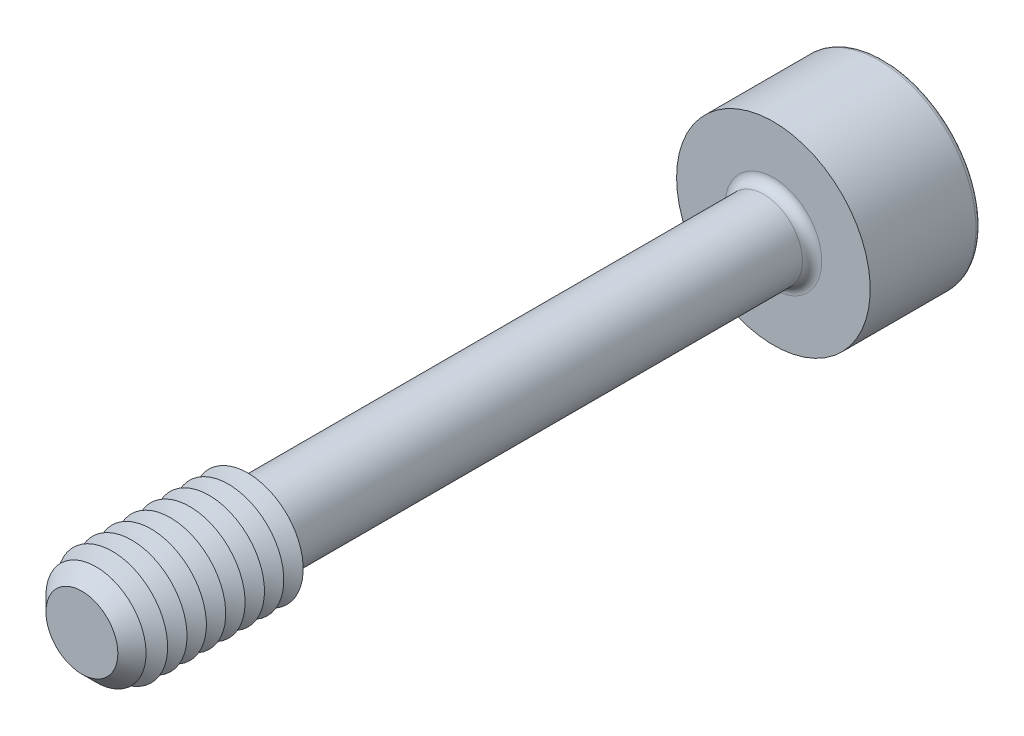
ISO-10303-21;
HEADER;
FILE_DESCRIPTION(('STEP AP214'),'2;1');
FILE_NAME('part.step','',(''),(''),'','','');
FILE_SCHEMA(('AUTOMOTIVE_DESIGN { 1 0 10303 214 1 1 1 1 }'));
ENDSEC;
DATA;
#1=APPLICATION_CONTEXT('core data for automotive mechanical design processes');
#2=APPLICATION_PROTOCOL_DEFINITION('international standard','automotive_design',2000,#1);
#3=PRODUCT_CONTEXT('',#1,'mechanical');
#4=PRODUCT('Part','Part','',(#3));
#5=PRODUCT_RELATED_PRODUCT_CATEGORY('part','',(#4));
#6=PRODUCT_DEFINITION_FORMATION('','',#4);
#7=PRODUCT_DEFINITION_CONTEXT('part definition',#1,'design');
#8=PRODUCT_DEFINITION('design','',#6,#7);
#9=PRODUCT_DEFINITION_SHAPE('','',#8);
#10=(LENGTH_UNIT() NAMED_UNIT(*) SI_UNIT(.MILLI.,.METRE.));
#11=(NAMED_UNIT(*) PLANE_ANGLE_UNIT() SI_UNIT($,.RADIAN.));
#12=(NAMED_UNIT(*) SI_UNIT($,.STERADIAN.) SOLID_ANGLE_UNIT());
#13=UNCERTAINTY_MEASURE_WITH_UNIT(LENGTH_MEASURE(1.E-05),#10,'distance_accuracy_value','');
#14=(GEOMETRIC_REPRESENTATION_CONTEXT(3) GLOBAL_UNCERTAINTY_ASSIGNED_CONTEXT((#13)) GLOBAL_UNIT_ASSIGNED_CONTEXT((#10,
#11,#12)) REPRESENTATION_CONTEXT('',''));
#15=CARTESIAN_POINT('',(0.,0.,0.));
#16=DIRECTION('',(0.,0.,1.));
#17=DIRECTION('',(1.,0.,0.));
#18=AXIS2_PLACEMENT_3D('',#15,#16,#17);
#19=CARTESIAN_POINT('',(-0.866025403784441,-1.5,-13.5));
#20=DIRECTION('',(0.,0.,1.));
#21=DIRECTION('',(1.,0.,0.));
#22=AXIS2_PLACEMENT_3D('',#19,#20,#21);
#23=PLANE('',#22);
#24=DIRECTION('',(1.,0.,0.));
#25=VECTOR('',#24,1.);
#26=CARTESIAN_POINT('',(-0.866025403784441,-1.5,-13.5));
#27=LINE('',#26,#25);
#28=CARTESIAN_POINT('',(0.,-1.5,-13.5));
#29=VERTEX_POINT('',#28);
#30=CARTESIAN_POINT('',(0.866025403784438,-1.5,-13.5));
#31=VERTEX_POINT('',#30);
#32=EDGE_CURVE('E761',#29,#31,#27,.T.);
#33=ORIENTED_EDGE('',*,*,#32,.F.);
#34=CARTESIAN_POINT('',(0.,0.,-13.5));
#35=DIRECTION('',(0.,0.,1.));
#36=DIRECTION('',(0.,-1.,0.));
#37=AXIS2_PLACEMENT_3D('',#34,#35,#36);
#38=CIRCLE('',#37,1.5);
#39=CARTESIAN_POINT('',(1.29903810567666,-0.75,-13.5));
#40=VERTEX_POINT('',#39);
#41=EDGE_CURVE('E53',#29,#40,#38,.T.);
#42=ORIENTED_EDGE('',*,*,#41,.T.);
#43=DIRECTION('',(0.5,0.866025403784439,0.));
#44=VECTOR('',#43,1.);
#45=CARTESIAN_POINT('',(0.866025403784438,-1.5,-13.5));
#46=LINE('',#45,#44);
#47=EDGE_CURVE('E748',#31,#40,#46,.T.);
#48=ORIENTED_EDGE('',*,*,#47,.F.);
#49=EDGE_LOOP('',(#33,#42,#48));
#50=FACE_BOUND('',#49,.T.);
#51=ADVANCED_FACE('F41',(#50),#23,.F.);
#52=CARTESIAN_POINT('',(1.73205080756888,0.,-13.5));
#53=VERTEX_POINT('',#52);
#54=EDGE_CURVE('E758',#40,#53,#46,.T.);
#55=ORIENTED_EDGE('',*,*,#54,.F.);
#56=CARTESIAN_POINT('',(1.29903810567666,0.749999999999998,-13.5));
#57=VERTEX_POINT('',#56);
#58=EDGE_CURVE('E11',#40,#57,#38,.T.);
#59=ORIENTED_EDGE('',*,*,#58,.T.);
#60=DIRECTION('',(-0.5,0.866025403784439,0.));
#61=VECTOR('',#60,1.);
#62=CARTESIAN_POINT('',(1.73205080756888,0.,-13.5));
#63=LINE('',#62,#61);
#64=EDGE_CURVE('E747',#53,#57,#63,.T.);
#65=ORIENTED_EDGE('',*,*,#64,.F.);
#66=EDGE_LOOP('',(#55,#59,#65));
#67=FACE_BOUND('',#66,.T.);
#68=ADVANCED_FACE('F133',(#67),#23,.F.);
#69=CARTESIAN_POINT('',(0.866025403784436,1.5,-13.5));
#70=VERTEX_POINT('',#69);
#71=EDGE_CURVE('E743',#57,#70,#63,.T.);
#72=ORIENTED_EDGE('',*,*,#71,.F.);
#73=CARTESIAN_POINT('',(0.,1.5,-13.5));
#74=VERTEX_POINT('',#73);
#75=EDGE_CURVE('E51',#57,#74,#38,.T.);
#76=ORIENTED_EDGE('',*,*,#75,.T.);
#77=DIRECTION('',(-1.,0.,0.));
#78=VECTOR('',#77,1.);
#79=CARTESIAN_POINT('',(0.866025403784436,1.5,-13.5));
#80=LINE('',#79,#78);
#81=EDGE_CURVE('E177',#70,#74,#80,.T.);
#82=ORIENTED_EDGE('',*,*,#81,.F.);
#83=EDGE_LOOP('',(#72,#76,#82));
#84=FACE_BOUND('',#83,.T.);
#85=ADVANCED_FACE('F139',(#84),#23,.F.);
#86=CARTESIAN_POINT('',(-0.866025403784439,1.5,-13.5));
#87=VERTEX_POINT('',#86);
#88=EDGE_CURVE('E753',#74,#87,#80,.T.);
#89=ORIENTED_EDGE('',*,*,#88,.F.);
#90=CARTESIAN_POINT('',(-1.29903810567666,0.749999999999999,-13.5));
#91=VERTEX_POINT('',#90);
#92=EDGE_CURVE('E264',#74,#91,#38,.T.);
#93=ORIENTED_EDGE('',*,*,#92,.T.);
#94=DIRECTION('',(-0.5,-0.866025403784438,0.));
#95=VECTOR('',#94,1.);
#96=CARTESIAN_POINT('',(-0.866025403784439,1.5,-13.5));
#97=LINE('',#96,#95);
#98=EDGE_CURVE('E176',#87,#91,#97,.T.);
#99=ORIENTED_EDGE('',*,*,#98,.F.);
#100=EDGE_LOOP('',(#89,#93,#99));
#101=FACE_BOUND('',#100,.T.);
#102=ADVANCED_FACE('F157',(#101),#23,.F.);
#103=CARTESIAN_POINT('',(-1.73205080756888,0.,-13.5));
#104=VERTEX_POINT('',#103);
#105=EDGE_CURVE('E170',#91,#104,#97,.T.);
#106=ORIENTED_EDGE('',*,*,#105,.F.);
#107=CARTESIAN_POINT('',(-1.29903810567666,-0.749999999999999,-13.5));
#108=VERTEX_POINT('',#107);
#109=EDGE_CURVE('E172',#91,#108,#38,.T.);
#110=ORIENTED_EDGE('',*,*,#109,.T.);
#111=DIRECTION('',(0.5,-0.866025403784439,0.));
#112=VECTOR('',#111,1.);
#113=CARTESIAN_POINT('',(-1.73205080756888,0.,-13.5));
#114=LINE('',#113,#112);
#115=EDGE_CURVE('E174',#104,#108,#114,.T.);
#116=ORIENTED_EDGE('',*,*,#115,.F.);
#117=EDGE_LOOP('',(#106,#110,#116));
#118=FACE_BOUND('',#117,.T.);
#119=ADVANCED_FACE('F146',(#118),#23,.F.);
#120=CARTESIAN_POINT('',(0.,0.,-16.5));
#121=DIRECTION('',(0.,0.,-1.));
#122=DIRECTION('',(-1.,0.,0.));
#123=AXIS2_PLACEMENT_3D('',#120,#121,#122);
#124=PLANE('',#123);
#125=CARTESIAN_POINT('',(0.,0.,-16.5));
#126=DIRECTION('',(0.,0.,-1.));
#127=DIRECTION('',(-1.,0.,0.));
#128=AXIS2_PLACEMENT_3D('',#125,#126,#127);
#129=CIRCLE('',#128,3.325);
#130=CARTESIAN_POINT('',(-3.325,0.,-16.5));
#131=VERTEX_POINT('',#130);
#132=EDGE_CURVE('E250',#131,#131,#129,.T.);
#133=ORIENTED_EDGE('',*,*,#132,.T.);
#134=EDGE_LOOP('',(#133));
#135=FACE_BOUND('',#134,.T.);
#136=DIRECTION('',(-0.5,-0.866025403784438,0.));
#137=VECTOR('',#136,1.);
#138=CARTESIAN_POINT('',(-0.866025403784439,1.5,-16.5));
#139=LINE('',#138,#137);
#140=CARTESIAN_POINT('',(-0.866025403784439,1.5,-16.5));
#141=VERTEX_POINT('',#140);
#142=CARTESIAN_POINT('',(-1.73205080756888,0.,-16.5));
#143=VERTEX_POINT('',#142);
#144=EDGE_CURVE('E212',#141,#143,#139,.T.);
#145=ORIENTED_EDGE('',*,*,#144,.T.);
#146=DIRECTION('',(0.5,-0.866025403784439,0.));
#147=VECTOR('',#146,1.);
#148=CARTESIAN_POINT('',(-1.73205080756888,0.,-16.5));
#149=LINE('',#148,#147);
#150=CARTESIAN_POINT('',(-0.866025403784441,-1.5,-16.5));
#151=VERTEX_POINT('',#150);
#152=EDGE_CURVE('E67',#143,#151,#149,.T.);
#153=ORIENTED_EDGE('',*,*,#152,.T.);
#154=DIRECTION('',(1.,0.,0.));
#155=VECTOR('',#154,1.);
#156=CARTESIAN_POINT('',(-0.866025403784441,-1.5,-16.5));
#157=LINE('',#156,#155);
#158=CARTESIAN_POINT('',(0.866025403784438,-1.5,-16.5));
#159=VERTEX_POINT('',#158);
#160=EDGE_CURVE('E196',#151,#159,#157,.T.);
#161=ORIENTED_EDGE('',*,*,#160,.T.);
#162=DIRECTION('',(0.5,0.866025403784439,0.));
#163=VECTOR('',#162,1.);
#164=CARTESIAN_POINT('',(0.866025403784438,-1.5,-16.5));
#165=LINE('',#164,#163);
#166=CARTESIAN_POINT('',(1.73205080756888,0.,-16.5));
#167=VERTEX_POINT('',#166);
#168=EDGE_CURVE('E200',#159,#167,#165,.T.);
#169=ORIENTED_EDGE('',*,*,#168,.T.);
#170=DIRECTION('',(-0.5,0.866025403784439,0.));
#171=VECTOR('',#170,1.);
#172=CARTESIAN_POINT('',(1.73205080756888,0.,-16.5));
#173=LINE('',#172,#171);
#174=CARTESIAN_POINT('',(0.866025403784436,1.5,-16.5));
#175=VERTEX_POINT('',#174);
#176=EDGE_CURVE('E204',#167,#175,#173,.T.);
#177=ORIENTED_EDGE('',*,*,#176,.T.);
#178=DIRECTION('',(-1.,0.,0.));
#179=VECTOR('',#178,1.);
#180=CARTESIAN_POINT('',(0.866025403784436,1.5,-16.5));
#181=LINE('',#180,#179);
#182=EDGE_CURVE('E208',#175,#141,#181,.T.);
#183=ORIENTED_EDGE('',*,*,#182,.T.);
#184=EDGE_LOOP('',(#145,#153,#161,#169,#177,#183));
#185=FACE_BOUND('',#184,.T.);
#186=ADVANCED_FACE('F156',(#135,#185),#124,.T.);
#187=CARTESIAN_POINT('',(0.,0.,12.5));
#188=DIRECTION('',(0.,0.,-1.));
#189=DIRECTION('',(-1.,0.,0.));
#190=AXIS2_PLACEMENT_3D('',#187,#188,#189);
#191=CYLINDRICAL_SURFACE('',#190,1.4);
#192=CARTESIAN_POINT('',(0.,0.,-12.15));
#193=DIRECTION('',(0.,0.,-1.));
#194=DIRECTION('',(-1.,0.,0.));
#195=AXIS2_PLACEMENT_3D('',#192,#193,#194);
#196=CIRCLE('',#195,1.4);
#197=CARTESIAN_POINT('',(-1.4,0.,-12.15));
#198=VERTEX_POINT('',#197);
#199=EDGE_CURVE('E246',#198,#198,#196,.F.);
#200=ORIENTED_EDGE('',*,*,#199,.T.);
#201=EDGE_LOOP('',(#200));
#202=FACE_BOUND('',#201,.T.);
#203=CARTESIAN_POINT('',(0.,0.,6.15358983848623));
#204=DIRECTION('',(0.,0.,-1.));
#205=DIRECTION('',(0.,1.,0.));
#206=AXIS2_PLACEMENT_3D('',#203,#204,#205);
#207=CIRCLE('',#206,1.4);
#208=CARTESIAN_POINT('',(0.,1.4,6.15358983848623));
#209=VERTEX_POINT('',#208);
#210=EDGE_CURVE('E234',#209,#209,#207,.T.);
#211=ORIENTED_EDGE('',*,*,#210,.T.);
#212=EDGE_LOOP('',(#211));
#213=FACE_BOUND('',#212,.T.);
#214=ADVANCED_FACE('F163',(#202,#213),#191,.T.);
#215=CARTESIAN_POINT('',(0.,0.,6.15358983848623));
#216=DIRECTION('',(0.,0.,1.));
#217=DIRECTION('',(0.,-1.,0.));
#218=AXIS2_PLACEMENT_3D('',#215,#216,#217);
#219=CONICAL_SURFACE('',#218,1.4,1.0471975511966);
#220=CARTESIAN_POINT('',(0.,0.,6.5));
#221=DIRECTION('',(0.,0.,-1.));
#222=DIRECTION('',(-1.,0.,0.));
#223=AXIS2_PLACEMENT_3D('',#220,#221,#222);
#224=CIRCLE('',#223,2.);
#225=CARTESIAN_POINT('',(-2.,0.,6.5));
#226=VERTEX_POINT('',#225);
#227=EDGE_CURVE('E267',#226,#226,#224,.T.);
#228=ORIENTED_EDGE('',*,*,#227,.T.);
#229=EDGE_LOOP('',(#228));
#230=FACE_BOUND('',#229,.T.);
#231=ORIENTED_EDGE('',*,*,#210,.F.);
#232=EDGE_LOOP('',(#231));
#233=FACE_BOUND('',#232,.T.);
#234=ADVANCED_FACE('F512',(#230,#233),#219,.T.);
#235=CARTESIAN_POINT('',(0.,0.,-12.5));
#236=DIRECTION('',(0.,0.,-1.));
#237=DIRECTION('',(-1.,0.,0.));
#238=AXIS2_PLACEMENT_3D('',#235,#236,#237);
#239=PLANE('',#238);
#240=CARTESIAN_POINT('',(0.,0.,-12.5));
#241=DIRECTION('',(0.,0.,-1.));
#242=DIRECTION('',(-1.,0.,0.));
#243=AXIS2_PLACEMENT_3D('',#240,#241,#242);
#244=CIRCLE('',#243,1.75);
#245=CARTESIAN_POINT('',(-1.75,0.,-12.5));
#246=VERTEX_POINT('',#245);
#247=EDGE_CURVE('E242',#246,#246,#244,.T.);
#248=ORIENTED_EDGE('',*,*,#247,.T.);
#249=EDGE_LOOP('',(#248));
#250=FACE_BOUND('',#249,.T.);
#251=CARTESIAN_POINT('',(0.,0.,-12.5));
#252=DIRECTION('',(0.,0.,-1.));
#253=DIRECTION('',(-1.,0.,0.));
#254=AXIS2_PLACEMENT_3D('',#251,#252,#253);
#255=CIRCLE('',#254,3.5);
#256=CARTESIAN_POINT('',(-3.5,0.,-12.5));
#257=VERTEX_POINT('',#256);
#258=EDGE_CURVE('E230',#257,#257,#255,.T.);
#259=ORIENTED_EDGE('',*,*,#258,.F.);
#260=EDGE_LOOP('',(#259));
#261=FACE_BOUND('',#260,.T.);
#262=ADVANCED_FACE('F505',(#250,#261),#239,.F.);
#263=CARTESIAN_POINT('',(0.,0.,-16.5));
#264=DIRECTION('',(0.,0.,1.));
#265=DIRECTION('',(1.,0.,0.));
#266=AXIS2_PLACEMENT_3D('',#263,#264,#265);
#267=CYLINDRICAL_SURFACE('',#266,3.5);
#268=CARTESIAN_POINT('',(0.,0.,-16.325));
#269=DIRECTION('',(0.,0.,-1.));
#270=DIRECTION('',(-1.,0.,0.));
#271=AXIS2_PLACEMENT_3D('',#268,#269,#270);
#272=CIRCLE('',#271,3.5);
#273=CARTESIAN_POINT('',(-3.5,0.,-16.325));
#274=VERTEX_POINT('',#273);
#275=EDGE_CURVE('E253',#274,#274,#272,.F.);
#276=ORIENTED_EDGE('',*,*,#275,.T.);
#277=EDGE_LOOP('',(#276));
#278=FACE_BOUND('',#277,.T.);
#279=ORIENTED_EDGE('',*,*,#258,.T.);
#280=EDGE_LOOP('',(#279));
#281=FACE_BOUND('',#280,.T.);
#282=ADVANCED_FACE('F511',(#278,#281),#267,.T.);
#283=CARTESIAN_POINT('',(-1.73205080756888,0.,-13.5));
#284=DIRECTION('',(0.866025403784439,0.5,0.));
#285=DIRECTION('',(-0.5,0.866025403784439,0.));
#286=AXIS2_PLACEMENT_3D('',#283,#284,#285);
#287=PLANE('',#286);
#288=ORIENTED_EDGE('',*,*,#152,.F.);
#289=DIRECTION('',(0.,0.,-1.));
#290=VECTOR('',#289,1.);
#291=CARTESIAN_POINT('',(-1.73205080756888,0.,-13.5));
#292=LINE('',#291,#290);
#293=EDGE_CURVE('E186',#104,#143,#292,.T.);
#294=ORIENTED_EDGE('',*,*,#293,.F.);
#295=ORIENTED_EDGE('',*,*,#115,.T.);
#296=CARTESIAN_POINT('',(-0.866025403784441,-1.5,-13.5));
#297=VERTEX_POINT('',#296);
#298=EDGE_CURVE('E215',#108,#297,#114,.T.);
#299=ORIENTED_EDGE('',*,*,#298,.T.);
#300=DIRECTION('',(0.,0.,-1.));
#301=VECTOR('',#300,1.);
#302=CARTESIAN_POINT('',(-0.866025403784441,-1.5,-13.5));
#303=LINE('',#302,#301);
#304=EDGE_CURVE('E227',#297,#151,#303,.T.);
#305=ORIENTED_EDGE('',*,*,#304,.T.);
#306=EDGE_LOOP('',(#288,#294,#295,#299,#305));
#307=FACE_BOUND('',#306,.T.);
#308=ADVANCED_FACE('F523',(#307),#287,.T.);
#309=CARTESIAN_POINT('',(-0.866025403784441,-1.5,-13.5));
#310=DIRECTION('',(0.,1.,0.));
#311=DIRECTION('',(0.,0.,1.));
#312=AXIS2_PLACEMENT_3D('',#309,#310,#311);
#313=PLANE('',#312);
#314=ORIENTED_EDGE('',*,*,#160,.F.);
#315=ORIENTED_EDGE('',*,*,#304,.F.);
#316=EDGE_CURVE('E759',#297,#29,#27,.T.);
#317=ORIENTED_EDGE('',*,*,#316,.T.);
#318=ORIENTED_EDGE('',*,*,#32,.T.);
#319=DIRECTION('',(0.,0.,-1.));
#320=VECTOR('',#319,1.);
#321=CARTESIAN_POINT('',(0.866025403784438,-1.5,-13.5));
#322=LINE('',#321,#320);
#323=EDGE_CURVE('E224',#31,#159,#322,.T.);
#324=ORIENTED_EDGE('',*,*,#323,.T.);
#325=EDGE_LOOP('',(#314,#315,#317,#318,#324));
#326=FACE_BOUND('',#325,.T.);
#327=ADVANCED_FACE('F539',(#326),#313,.T.);
#328=CARTESIAN_POINT('',(0.866025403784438,-1.5,-13.5));
#329=DIRECTION('',(-0.866025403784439,0.5,0.));
#330=DIRECTION('',(-0.5,-0.866025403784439,0.));
#331=AXIS2_PLACEMENT_3D('',#328,#329,#330);
#332=PLANE('',#331);
#333=ORIENTED_EDGE('',*,*,#168,.F.);
#334=ORIENTED_EDGE('',*,*,#323,.F.);
#335=ORIENTED_EDGE('',*,*,#47,.T.);
#336=ORIENTED_EDGE('',*,*,#54,.T.);
#337=DIRECTION('',(0.,0.,-1.));
#338=VECTOR('',#337,1.);
#339=CARTESIAN_POINT('',(1.73205080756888,0.,-13.5));
#340=LINE('',#339,#338);
#341=EDGE_CURVE('E221',#53,#167,#340,.T.);
#342=ORIENTED_EDGE('',*,*,#341,.T.);
#343=EDGE_LOOP('',(#333,#334,#335,#336,#342));
#344=FACE_BOUND('',#343,.T.);
#345=ADVANCED_FACE('F549',(#344),#332,.T.);
#346=CARTESIAN_POINT('',(1.73205080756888,0.,-13.5));
#347=DIRECTION('',(-0.866025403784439,-0.5,0.));
#348=DIRECTION('',(0.5,-0.866025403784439,0.));
#349=AXIS2_PLACEMENT_3D('',#346,#347,#348);
#350=PLANE('',#349);
#351=ORIENTED_EDGE('',*,*,#176,.F.);
#352=ORIENTED_EDGE('',*,*,#341,.F.);
#353=ORIENTED_EDGE('',*,*,#64,.T.);
#354=ORIENTED_EDGE('',*,*,#71,.T.);
#355=DIRECTION('',(0.,0.,-1.));
#356=VECTOR('',#355,1.);
#357=CARTESIAN_POINT('',(0.866025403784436,1.5,-13.5));
#358=LINE('',#357,#356);
#359=EDGE_CURVE('E218',#70,#175,#358,.T.);
#360=ORIENTED_EDGE('',*,*,#359,.T.);
#361=EDGE_LOOP('',(#351,#352,#353,#354,#360));
#362=FACE_BOUND('',#361,.T.);
#363=ADVANCED_FACE('F559',(#362),#350,.T.);
#364=CARTESIAN_POINT('',(0.866025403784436,1.5,-13.5));
#365=DIRECTION('',(0.,-1.,0.));
#366=DIRECTION('',(0.,0.,-1.));
#367=AXIS2_PLACEMENT_3D('',#364,#365,#366);
#368=PLANE('',#367);
#369=ORIENTED_EDGE('',*,*,#182,.F.);
#370=ORIENTED_EDGE('',*,*,#359,.F.);
#371=ORIENTED_EDGE('',*,*,#81,.T.);
#372=ORIENTED_EDGE('',*,*,#88,.T.);
#373=DIRECTION('',(0.,0.,-1.));
#374=VECTOR('',#373,1.);
#375=CARTESIAN_POINT('',(-0.866025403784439,1.5,-13.5));
#376=LINE('',#375,#374);
#377=EDGE_CURVE('E182',#87,#141,#376,.T.);
#378=ORIENTED_EDGE('',*,*,#377,.T.);
#379=EDGE_LOOP('',(#369,#370,#371,#372,#378));
#380=FACE_BOUND('',#379,.T.);
#381=ADVANCED_FACE('F152',(#380),#368,.T.);
#382=CARTESIAN_POINT('',(-0.866025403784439,1.5,-13.5));
#383=DIRECTION('',(0.866025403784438,-0.5,0.));
#384=DIRECTION('',(0.5,0.866025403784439,0.));
#385=AXIS2_PLACEMENT_3D('',#382,#383,#384);
#386=PLANE('',#385);
#387=ORIENTED_EDGE('',*,*,#144,.F.);
#388=ORIENTED_EDGE('',*,*,#377,.F.);
#389=ORIENTED_EDGE('',*,*,#98,.T.);
#390=ORIENTED_EDGE('',*,*,#105,.T.);
#391=ORIENTED_EDGE('',*,*,#293,.T.);
#392=EDGE_LOOP('',(#387,#388,#389,#390,#391));
#393=FACE_BOUND('',#392,.T.);
#394=ADVANCED_FACE('F144',(#393),#386,.T.);
#395=ORIENTED_EDGE('',*,*,#298,.F.);
#396=EDGE_CURVE('E256',#108,#29,#38,.T.);
#397=ORIENTED_EDGE('',*,*,#396,.T.);
#398=ORIENTED_EDGE('',*,*,#316,.F.);
#399=EDGE_LOOP('',(#395,#397,#398));
#400=FACE_BOUND('',#399,.T.);
#401=ADVANCED_FACE('F135',(#400),#23,.F.);
#402=CARTESIAN_POINT('',(0.,0.,-12.15));
#403=DIRECTION('',(0.,0.,-1.));
#404=DIRECTION('',(-1.,0.,0.));
#405=AXIS2_PLACEMENT_3D('',#402,#403,#404);
#406=TOROIDAL_SURFACE('',#405,1.75,0.35);
#407=ORIENTED_EDGE('',*,*,#199,.F.);
#408=EDGE_LOOP('',(#407));
#409=FACE_BOUND('',#408,.T.);
#410=ORIENTED_EDGE('',*,*,#247,.F.);
#411=EDGE_LOOP('',(#410));
#412=FACE_BOUND('',#411,.T.);
#413=ADVANCED_FACE('F129',(#409,#412),#406,.F.);
#414=CARTESIAN_POINT('',(0.,0.,-16.325));
#415=DIRECTION('',(0.,0.,-1.));
#416=DIRECTION('',(-1.,0.,0.));
#417=AXIS2_PLACEMENT_3D('',#414,#415,#416);
#418=TOROIDAL_SURFACE('',#417,3.325,0.175);
#419=ORIENTED_EDGE('',*,*,#275,.F.);
#420=EDGE_LOOP('',(#419));
#421=FACE_BOUND('',#420,.T.);
#422=ORIENTED_EDGE('',*,*,#132,.F.);
#423=EDGE_LOOP('',(#422));
#424=FACE_BOUND('',#423,.T.);
#425=ADVANCED_FACE('F43',(#421,#424),#418,.T.);
#426=CARTESIAN_POINT('',(0.,0.,-12.6339745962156));
#427=DIRECTION('',(0.,0.,-1.));
#428=DIRECTION('',(0.,1.,0.));
#429=AXIS2_PLACEMENT_3D('',#426,#427,#428);
#430=CONICAL_SURFACE('',#429,0.,1.0471975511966);
#431=ORIENTED_EDGE('',*,*,#41,.F.);
#432=ORIENTED_EDGE('',*,*,#396,.F.);
#433=ORIENTED_EDGE('',*,*,#109,.F.);
#434=ORIENTED_EDGE('',*,*,#92,.F.);
#435=ORIENTED_EDGE('',*,*,#75,.F.);
#436=ORIENTED_EDGE('',*,*,#58,.F.);
#437=EDGE_LOOP('',(#431,#432,#433,#434,#435,#436));
#438=FACE_BOUND('',#437,.T.);
#439=CARTESIAN_POINT('',(0.,0.,-12.6339745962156));
#440=VERTEX_POINT('',#439);
#441=VERTEX_LOOP('',#440);
#442=FACE_BOUND('',#441,.T.);
#443=ADVANCED_FACE('F118',(#438,#442),#430,.F.);
#444=CARTESIAN_POINT('',(0.,0.,6.85));
#445=DIRECTION('',(0.,0.,-1.));
#446=DIRECTION('',(-1.,0.,0.));
#447=AXIS2_PLACEMENT_3D('',#444,#445,#446);
#448=CONICAL_SURFACE('',#447,1.39378221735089,1.0471975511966);
#449=ORIENTED_EDGE('',*,*,#227,.F.);
#450=EDGE_LOOP('',(#449));
#451=FACE_BOUND('',#450,.T.);
#452=CARTESIAN_POINT('',(0.,0.,6.85));
#453=DIRECTION('',(0.,0.,-1.));
#454=DIRECTION('',(-1.,0.,0.));
#455=AXIS2_PLACEMENT_3D('',#452,#453,#454);
#456=CIRCLE('',#455,1.39378221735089);
#457=CARTESIAN_POINT('',(-1.39378221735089,0.,6.85));
#458=VERTEX_POINT('',#457);
#459=EDGE_CURVE('E273',#458,#458,#456,.T.);
#460=ORIENTED_EDGE('',*,*,#459,.T.);
#461=EDGE_LOOP('',(#460));
#462=FACE_BOUND('',#461,.T.);
#463=ADVANCED_FACE('F120',(#451,#462),#448,.T.);
#464=CARTESIAN_POINT('',(0.,0.,7.2));
#465=DIRECTION('',(0.,0.,1.));
#466=DIRECTION('',(1.,0.,0.));
#467=AXIS2_PLACEMENT_3D('',#464,#465,#466);
#468=CONICAL_SURFACE('',#467,2.,1.0471975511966);
#469=ORIENTED_EDGE('',*,*,#459,.F.);
#470=EDGE_LOOP('',(#469));
#471=FACE_BOUND('',#470,.T.);
#472=CARTESIAN_POINT('',(0.,0.,7.2));
#473=DIRECTION('',(0.,0.,-1.));
#474=DIRECTION('',(-1.,0.,0.));
#475=AXIS2_PLACEMENT_3D('',#472,#473,#474);
#476=CIRCLE('',#475,2.);
#477=CARTESIAN_POINT('',(-2.,0.,7.2));
#478=VERTEX_POINT('',#477);
#479=EDGE_CURVE('E280',#478,#478,#476,.T.);
#480=ORIENTED_EDGE('',*,*,#479,.T.);
#481=EDGE_LOOP('',(#480));
#482=FACE_BOUND('',#481,.T.);
#483=ADVANCED_FACE('F126',(#471,#482),#468,.T.);
#484=CARTESIAN_POINT('',(0.,0.,7.55));
#485=DIRECTION('',(0.,0.,-1.));
#486=DIRECTION('',(-1.,0.,0.));
#487=AXIS2_PLACEMENT_3D('',#484,#485,#486);
#488=CONICAL_SURFACE('',#487,1.39378221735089,1.0471975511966);
#489=ORIENTED_EDGE('',*,*,#479,.F.);
#490=EDGE_LOOP('',(#489));
#491=FACE_BOUND('',#490,.T.);
#492=CARTESIAN_POINT('',(0.,0.,7.55));
#493=DIRECTION('',(0.,0.,-1.));
#494=DIRECTION('',(-1.,0.,0.));
#495=AXIS2_PLACEMENT_3D('',#492,#493,#494);
#496=CIRCLE('',#495,1.39378221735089);
#497=CARTESIAN_POINT('',(-1.39378221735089,0.,7.55));
#498=VERTEX_POINT('',#497);
#499=EDGE_CURVE('E286',#498,#498,#496,.T.);
#500=ORIENTED_EDGE('',*,*,#499,.T.);
#501=EDGE_LOOP('',(#500));
#502=FACE_BOUND('',#501,.T.);
#503=ADVANCED_FACE('F399',(#491,#502),#488,.T.);
#504=CARTESIAN_POINT('',(0.,0.,7.9));
#505=DIRECTION('',(0.,0.,1.));
#506=DIRECTION('',(1.,0.,0.));
#507=AXIS2_PLACEMENT_3D('',#504,#505,#506);
#508=CONICAL_SURFACE('',#507,2.,1.0471975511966);
#509=ORIENTED_EDGE('',*,*,#499,.F.);
#510=EDGE_LOOP('',(#509));
#511=FACE_BOUND('',#510,.T.);
#512=CARTESIAN_POINT('',(0.,0.,7.9));
#513=DIRECTION('',(0.,0.,-1.));
#514=DIRECTION('',(-1.,0.,0.));
#515=AXIS2_PLACEMENT_3D('',#512,#513,#514);
#516=CIRCLE('',#515,2.);
#517=CARTESIAN_POINT('',(-2.,0.,7.9));
#518=VERTEX_POINT('',#517);
#519=EDGE_CURVE('E290',#518,#518,#516,.T.);
#520=ORIENTED_EDGE('',*,*,#519,.T.);
#521=EDGE_LOOP('',(#520));
#522=FACE_BOUND('',#521,.T.);
#523=ADVANCED_FACE('F395',(#511,#522),#508,.T.);
#524=CARTESIAN_POINT('',(0.,0.,8.25));
#525=DIRECTION('',(0.,0.,-1.));
#526=DIRECTION('',(-1.,0.,0.));
#527=AXIS2_PLACEMENT_3D('',#524,#525,#526);
#528=CONICAL_SURFACE('',#527,1.39378221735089,1.0471975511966);
#529=ORIENTED_EDGE('',*,*,#519,.F.);
#530=EDGE_LOOP('',(#529));
#531=FACE_BOUND('',#530,.T.);
#532=CARTESIAN_POINT('',(0.,0.,8.25));
#533=DIRECTION('',(0.,0.,-1.));
#534=DIRECTION('',(-1.,0.,0.));
#535=AXIS2_PLACEMENT_3D('',#532,#533,#534);
#536=CIRCLE('',#535,1.39378221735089);
#537=CARTESIAN_POINT('',(-1.39378221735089,0.,8.25));
#538=VERTEX_POINT('',#537);
#539=EDGE_CURVE('E294',#538,#538,#536,.T.);
#540=ORIENTED_EDGE('',*,*,#539,.T.);
#541=EDGE_LOOP('',(#540));
#542=FACE_BOUND('',#541,.T.);
#543=ADVANCED_FACE('F391',(#531,#542),#528,.T.);
#544=CARTESIAN_POINT('',(0.,0.,8.6));
#545=DIRECTION('',(0.,0.,1.));
#546=DIRECTION('',(1.,0.,0.));
#547=AXIS2_PLACEMENT_3D('',#544,#545,#546);
#548=CONICAL_SURFACE('',#547,2.,1.0471975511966);
#549=ORIENTED_EDGE('',*,*,#539,.F.);
#550=EDGE_LOOP('',(#549));
#551=FACE_BOUND('',#550,.T.);
#552=CARTESIAN_POINT('',(0.,0.,8.6));
#553=DIRECTION('',(0.,0.,-1.));
#554=DIRECTION('',(-1.,0.,0.));
#555=AXIS2_PLACEMENT_3D('',#552,#553,#554);
#556=CIRCLE('',#555,2.);
#557=CARTESIAN_POINT('',(-2.,0.,8.6));
#558=VERTEX_POINT('',#557);
#559=EDGE_CURVE('E298',#558,#558,#556,.T.);
#560=ORIENTED_EDGE('',*,*,#559,.T.);
#561=EDGE_LOOP('',(#560));
#562=FACE_BOUND('',#561,.T.);
#563=ADVANCED_FACE('F387',(#551,#562),#548,.T.);
#564=CARTESIAN_POINT('',(0.,0.,8.95));
#565=DIRECTION('',(0.,0.,-1.));
#566=DIRECTION('',(-1.,0.,0.));
#567=AXIS2_PLACEMENT_3D('',#564,#565,#566);
#568=CONICAL_SURFACE('',#567,1.39378221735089,1.0471975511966);
#569=ORIENTED_EDGE('',*,*,#559,.F.);
#570=EDGE_LOOP('',(#569));
#571=FACE_BOUND('',#570,.T.);
#572=CARTESIAN_POINT('',(0.,0.,8.95));
#573=DIRECTION('',(0.,0.,-1.));
#574=DIRECTION('',(-1.,0.,0.));
#575=AXIS2_PLACEMENT_3D('',#572,#573,#574);
#576=CIRCLE('',#575,1.39378221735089);
#577=CARTESIAN_POINT('',(-1.39378221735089,0.,8.95));
#578=VERTEX_POINT('',#577);
#579=EDGE_CURVE('E301',#578,#578,#576,.T.);
#580=ORIENTED_EDGE('',*,*,#579,.T.);
#581=EDGE_LOOP('',(#580));
#582=FACE_BOUND('',#581,.T.);
#583=ADVANCED_FACE('F383',(#571,#582),#568,.T.);
#584=CARTESIAN_POINT('',(0.,0.,9.3));
#585=DIRECTION('',(0.,0.,1.));
#586=DIRECTION('',(1.,0.,0.));
#587=AXIS2_PLACEMENT_3D('',#584,#585,#586);
#588=CONICAL_SURFACE('',#587,2.,1.0471975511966);
#589=ORIENTED_EDGE('',*,*,#579,.F.);
#590=EDGE_LOOP('',(#589));
#591=FACE_BOUND('',#590,.T.);
#592=CARTESIAN_POINT('',(0.,0.,9.3));
#593=DIRECTION('',(0.,0.,-1.));
#594=DIRECTION('',(-1.,0.,0.));
#595=AXIS2_PLACEMENT_3D('',#592,#593,#594);
#596=CIRCLE('',#595,2.);
#597=CARTESIAN_POINT('',(-2.,0.,9.3));
#598=VERTEX_POINT('',#597);
#599=EDGE_CURVE('E305',#598,#598,#596,.T.);
#600=ORIENTED_EDGE('',*,*,#599,.T.);
#601=EDGE_LOOP('',(#600));
#602=FACE_BOUND('',#601,.T.);
#603=ADVANCED_FACE('F379',(#591,#602),#588,.T.);
#604=CARTESIAN_POINT('',(0.,0.,9.65));
#605=DIRECTION('',(0.,0.,-1.));
#606=DIRECTION('',(-1.,0.,0.));
#607=AXIS2_PLACEMENT_3D('',#604,#605,#606);
#608=CONICAL_SURFACE('',#607,1.39378221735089,1.0471975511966);
#609=ORIENTED_EDGE('',*,*,#599,.F.);
#610=EDGE_LOOP('',(#609));
#611=FACE_BOUND('',#610,.T.);
#612=CARTESIAN_POINT('',(0.,0.,9.65));
#613=DIRECTION('',(0.,0.,-1.));
#614=DIRECTION('',(-1.,0.,0.));
#615=AXIS2_PLACEMENT_3D('',#612,#613,#614);
#616=CIRCLE('',#615,1.39378221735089);
#617=CARTESIAN_POINT('',(-1.39378221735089,0.,9.65));
#618=VERTEX_POINT('',#617);
#619=EDGE_CURVE('E309',#618,#618,#616,.T.);
#620=ORIENTED_EDGE('',*,*,#619,.T.);
#621=EDGE_LOOP('',(#620));
#622=FACE_BOUND('',#621,.T.);
#623=ADVANCED_FACE('F375',(#611,#622),#608,.T.);
#624=CARTESIAN_POINT('',(0.,0.,10.));
#625=DIRECTION('',(0.,0.,1.));
#626=DIRECTION('',(1.,0.,0.));
#627=AXIS2_PLACEMENT_3D('',#624,#625,#626);
#628=CONICAL_SURFACE('',#627,2.,1.0471975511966);
#629=ORIENTED_EDGE('',*,*,#619,.F.);
#630=EDGE_LOOP('',(#629));
#631=FACE_BOUND('',#630,.T.);
#632=CARTESIAN_POINT('',(0.,0.,10.));
#633=DIRECTION('',(0.,0.,-1.));
#634=DIRECTION('',(-1.,0.,0.));
#635=AXIS2_PLACEMENT_3D('',#632,#633,#634);
#636=CIRCLE('',#635,2.);
#637=CARTESIAN_POINT('',(-2.,0.,10.));
#638=VERTEX_POINT('',#637);
#639=EDGE_CURVE('E313',#638,#638,#636,.T.);
#640=ORIENTED_EDGE('',*,*,#639,.T.);
#641=EDGE_LOOP('',(#640));
#642=FACE_BOUND('',#641,.T.);
#643=ADVANCED_FACE('F371',(#631,#642),#628,.T.);
#644=CARTESIAN_POINT('',(0.,0.,10.35));
#645=DIRECTION('',(0.,0.,-1.));
#646=DIRECTION('',(-1.,0.,0.));
#647=AXIS2_PLACEMENT_3D('',#644,#645,#646);
#648=CONICAL_SURFACE('',#647,1.39378221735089,1.0471975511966);
#649=ORIENTED_EDGE('',*,*,#639,.F.);
#650=EDGE_LOOP('',(#649));
#651=FACE_BOUND('',#650,.T.);
#652=CARTESIAN_POINT('',(0.,0.,10.35));
#653=DIRECTION('',(0.,0.,-1.));
#654=DIRECTION('',(-1.,0.,0.));
#655=AXIS2_PLACEMENT_3D('',#652,#653,#654);
#656=CIRCLE('',#655,1.39378221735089);
#657=CARTESIAN_POINT('',(-1.39378221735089,0.,10.35));
#658=VERTEX_POINT('',#657);
#659=EDGE_CURVE('E317',#658,#658,#656,.T.);
#660=ORIENTED_EDGE('',*,*,#659,.T.);
#661=EDGE_LOOP('',(#660));
#662=FACE_BOUND('',#661,.T.);
#663=ADVANCED_FACE('F367',(#651,#662),#648,.T.);
#664=CARTESIAN_POINT('',(0.,0.,10.7));
#665=DIRECTION('',(0.,0.,1.));
#666=DIRECTION('',(1.,0.,0.));
#667=AXIS2_PLACEMENT_3D('',#664,#665,#666);
#668=CONICAL_SURFACE('',#667,2.,1.0471975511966);
#669=ORIENTED_EDGE('',*,*,#659,.F.);
#670=EDGE_LOOP('',(#669));
#671=FACE_BOUND('',#670,.T.);
#672=CARTESIAN_POINT('',(0.,0.,10.7));
#673=DIRECTION('',(0.,0.,-1.));
#674=DIRECTION('',(-1.,0.,0.));
#675=AXIS2_PLACEMENT_3D('',#672,#673,#674);
#676=CIRCLE('',#675,2.);
#677=CARTESIAN_POINT('',(-2.,0.,10.7));
#678=VERTEX_POINT('',#677);
#679=EDGE_CURVE('E321',#678,#678,#676,.T.);
#680=ORIENTED_EDGE('',*,*,#679,.T.);
#681=EDGE_LOOP('',(#680));
#682=FACE_BOUND('',#681,.T.);
#683=ADVANCED_FACE('F363',(#671,#682),#668,.T.);
#684=CARTESIAN_POINT('',(0.,0.,11.05));
#685=DIRECTION('',(0.,0.,-1.));
#686=DIRECTION('',(-1.,0.,0.));
#687=AXIS2_PLACEMENT_3D('',#684,#685,#686);
#688=CONICAL_SURFACE('',#687,1.39378221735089,1.0471975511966);
#689=ORIENTED_EDGE('',*,*,#679,.F.);
#690=EDGE_LOOP('',(#689));
#691=FACE_BOUND('',#690,.T.);
#692=CARTESIAN_POINT('',(0.,0.,11.05));
#693=DIRECTION('',(0.,0.,-1.));
#694=DIRECTION('',(-1.,0.,0.));
#695=AXIS2_PLACEMENT_3D('',#692,#693,#694);
#696=CIRCLE('',#695,1.39378221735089);
#697=CARTESIAN_POINT('',(-1.39378221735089,0.,11.05));
#698=VERTEX_POINT('',#697);
#699=EDGE_CURVE('E325',#698,#698,#696,.T.);
#700=ORIENTED_EDGE('',*,*,#699,.T.);
#701=EDGE_LOOP('',(#700));
#702=FACE_BOUND('',#701,.T.);
#703=ADVANCED_FACE('F359',(#691,#702),#688,.T.);
#704=CARTESIAN_POINT('',(0.,0.,11.4));
#705=DIRECTION('',(0.,0.,1.));
#706=DIRECTION('',(1.,0.,0.));
#707=AXIS2_PLACEMENT_3D('',#704,#705,#706);
#708=CONICAL_SURFACE('',#707,2.,1.0471975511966);
#709=ORIENTED_EDGE('',*,*,#699,.F.);
#710=EDGE_LOOP('',(#709));
#711=FACE_BOUND('',#710,.T.);
#712=CARTESIAN_POINT('',(0.,0.,11.4));
#713=DIRECTION('',(0.,0.,-1.));
#714=DIRECTION('',(-1.,0.,0.));
#715=AXIS2_PLACEMENT_3D('',#712,#713,#714);
#716=CIRCLE('',#715,2.);
#717=CARTESIAN_POINT('',(-2.,0.,11.4));
#718=VERTEX_POINT('',#717);
#719=EDGE_CURVE('E329',#718,#718,#716,.T.);
#720=ORIENTED_EDGE('',*,*,#719,.T.);
#721=EDGE_LOOP('',(#720));
#722=FACE_BOUND('',#721,.T.);
#723=ADVANCED_FACE('F352',(#711,#722),#708,.T.);
#724=CARTESIAN_POINT('',(0.,0.,11.75));
#725=DIRECTION('',(0.,0.,-1.));
#726=DIRECTION('',(-1.,0.,0.));
#727=AXIS2_PLACEMENT_3D('',#724,#725,#726);
#728=CONICAL_SURFACE('',#727,1.39378221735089,1.0471975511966);
#729=ORIENTED_EDGE('',*,*,#719,.F.);
#730=EDGE_LOOP('',(#729));
#731=FACE_BOUND('',#730,.T.);
#732=CARTESIAN_POINT('',(0.,0.,11.75));
#733=DIRECTION('',(0.,0.,-1.));
#734=DIRECTION('',(-1.,0.,0.));
#735=AXIS2_PLACEMENT_3D('',#732,#733,#734);
#736=CIRCLE('',#735,1.39378221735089);
#737=CARTESIAN_POINT('',(-1.39378221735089,0.,11.75));
#738=VERTEX_POINT('',#737);
#739=EDGE_CURVE('E333',#738,#738,#736,.T.);
#740=ORIENTED_EDGE('',*,*,#739,.T.);
#741=EDGE_LOOP('',(#740));
#742=FACE_BOUND('',#741,.T.);
#743=ADVANCED_FACE('F338',(#731,#742),#728,.T.);
#744=CARTESIAN_POINT('',(0.,0.,12.1));
#745=DIRECTION('',(0.,0.,1.));
#746=DIRECTION('',(1.,0.,0.));
#747=AXIS2_PLACEMENT_3D('',#744,#745,#746);
#748=CONICAL_SURFACE('',#747,2.,1.0471975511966);
#749=CARTESIAN_POINT('',(0.,0.,11.9901923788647));
#750=DIRECTION('',(0.,0.,1.));
#751=DIRECTION('',(1.,0.,0.));
#752=AXIS2_PLACEMENT_3D('',#749,#750,#751);
#753=CIRCLE('',#752,1.80980762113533);
#754=CARTESIAN_POINT('',(1.80980762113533,0.,11.9901923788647));
#755=VERTEX_POINT('',#754);
#756=EDGE_CURVE('E45',#755,#755,#753,.F.);
#757=ORIENTED_EDGE('',*,*,#756,.T.);
#758=EDGE_LOOP('',(#757));
#759=FACE_BOUND('',#758,.T.);
#760=ORIENTED_EDGE('',*,*,#739,.F.);
#761=EDGE_LOOP('',(#760));
#762=FACE_BOUND('',#761,.T.);
#763=ADVANCED_FACE('F340',(#759,#762),#748,.T.);
#764=CARTESIAN_POINT('',(0.,0.,12.5));
#765=DIRECTION('',(0.,0.,1.));
#766=DIRECTION('',(1.,0.,0.));
#767=AXIS2_PLACEMENT_3D('',#764,#765,#766);
#768=PLANE('',#767);
#769=CARTESIAN_POINT('',(0.,0.,12.5));
#770=DIRECTION('',(0.,0.,1.));
#771=DIRECTION('',(1.,0.,0.));
#772=AXIS2_PLACEMENT_3D('',#769,#770,#771);
#773=CIRCLE('',#772,1.3);
#774=CARTESIAN_POINT('',(1.3,0.,12.5));
#775=VERTEX_POINT('',#774);
#776=EDGE_CURVE('E238',#775,#775,#773,.T.);
#777=ORIENTED_EDGE('',*,*,#776,.T.);
#778=EDGE_LOOP('',(#777));
#779=FACE_BOUND('',#778,.T.);
#780=ADVANCED_FACE('F342',(#779),#768,.T.);
#781=CARTESIAN_POINT('',(0.,0.,11.8));
#782=DIRECTION('',(0.,0.,-1.));
#783=DIRECTION('',(0.,1.,0.));
#784=AXIS2_PLACEMENT_3D('',#781,#782,#783);
#785=CONICAL_SURFACE('',#784,2.,0.785398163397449);
#786=ORIENTED_EDGE('',*,*,#756,.F.);
#787=EDGE_LOOP('',(#786));
#788=FACE_BOUND('',#787,.T.);
#789=ORIENTED_EDGE('',*,*,#776,.F.);
#790=EDGE_LOOP('',(#789));
#791=FACE_BOUND('',#790,.T.);
#792=ADVANCED_FACE('F349',(#788,#791),#785,.T.);
#793=CLOSED_SHELL('',(#51,#68,#85,#102,#119,#186,#214,#234,#262,#282,#308,#327,#345,#363,#381,
#394,#401,#413,#425,#443,#463,#483,#503,#523,#543,#563,#583,#603,#623,#643,#663,#683,#703,#723,
#743,#763,#780,#792));
#794=MANIFOLD_SOLID_BREP('B2',#793);
#795=ADVANCED_BREP_SHAPE_REPRESENTATION('',(#18,#794),#14);
#796=SHAPE_DEFINITION_REPRESENTATION(#9,#795);
ENDSEC;
END-ISO-10303-21;
